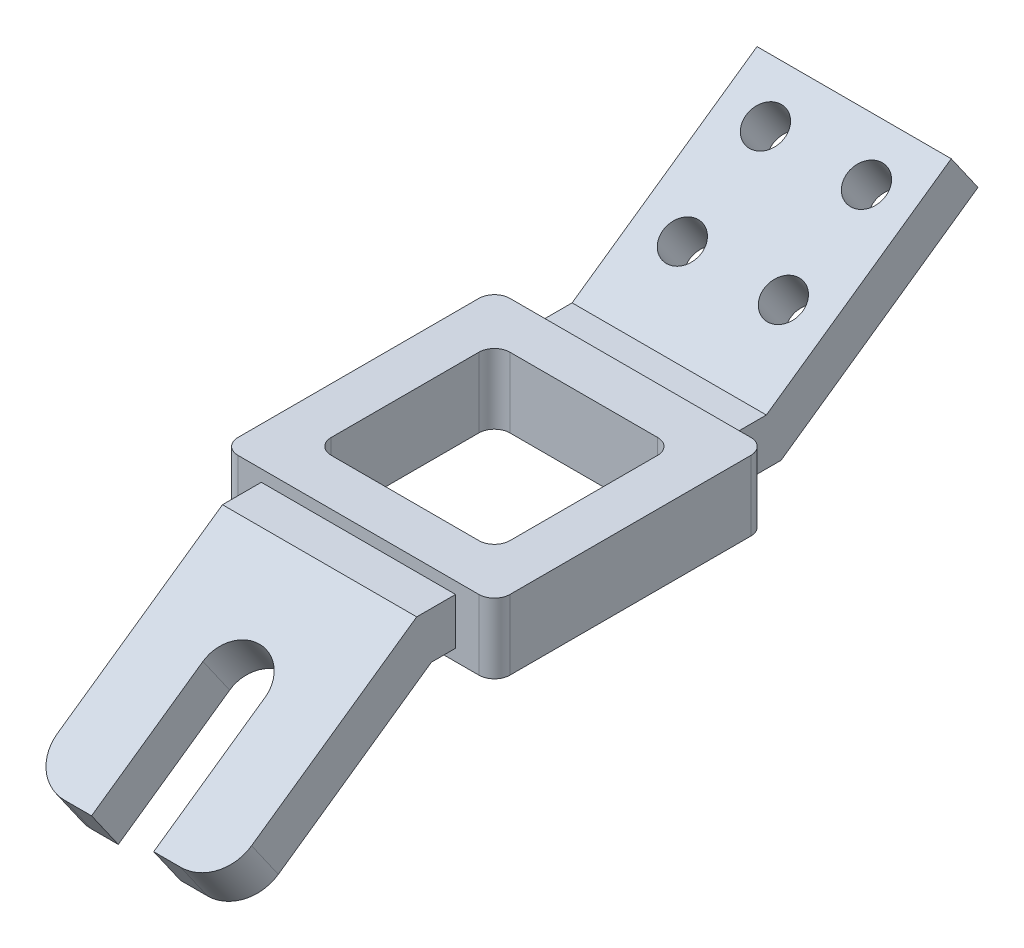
from build123d import *

# Parameters (mm, degrees)
EXTRUDE_THIN1_DEPTH = 31.75
SKETCH2_W           = 88.9
SKETCH2_H           = 88.9
EXTRUDE1_DEPTH      = 11.43
FILLET1_R           = 5.08
SKETCH3_W           = 58.42
SKETCH3_H           = 58.42
CUT_EXTRUDE1_DEPTH  = 146.273023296
FILLET2_R           = 5.08
FILLET3_R           = 12.7
CUT_EXTRUDE2_DEPTH  = 175.682206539
SKETCH5_R           = 6.35
F_4_HOLE_CUT_DEPTH  = 162.557562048


with BuildPart() as part:
    # Sketch1 → Extrude-Thin1 (new, symmetric)
    with BuildSketch(Plane(origin=(0, 0, 0), x_dir=(0, 0, -1), z_dir=(1, 0, 0))):
        Polygon((-115.19873333, -49.948463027), (-54.747423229, -7.62), (59.552576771, -7.62), (123.94003822, 37.464585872), (115.19873333, 49.948463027), (54.747423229, 7.62), (-59.552576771, 7.62), (-123.94003822, -37.464585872), align=None)
    extrude(amount=EXTRUDE_THIN1_DEPTH, both=True)

    # Sketch2 → Extrude1 (add, symmetric)
    with BuildSketch(Plane(origin=(0, 0, 0), x_dir=(1, 0, 0), z_dir=(0, 1, 0))):
        with Locations((0, -2.402576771)):
            Rectangle(SKETCH2_W, SKETCH2_H)
    extrude(amount=EXTRUDE1_DEPTH, both=True)

    # Fillet1
    fillet1_edges = [part.edges().sort_by_distance(p)[0] for p in [
        (-44.45, 0, 46.852576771),
        (44.45, 0, -42.047423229),
        (-44.45, 0, -42.047423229),
        (44.45, 0, 46.852576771),
    ]]
    fillet(fillet1_edges, radius=FILLET1_R)

    # Sketch3 → Cut-Extrude1 (cut, through all)
    with BuildSketch(Plane(origin=(0, 11.43, 0), x_dir=(-1, 0, 0), z_dir=(0, 1, 0))):
        with Locations((0, 2.402576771)):
            Rectangle(SKETCH3_W, SKETCH3_H)
    extrude(amount=-CUT_EXTRUDE1_DEPTH, mode=Mode.SUBTRACT)

    # Fillet2
    fillet2_edges = [part.edges().sort_by_distance(p)[0] for p in [
        (-29.21, 0, -26.807423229),
        (29.21, 0, -26.807423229),
        (29.21, 0, 31.612576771),
        (-29.21, 0, 31.612576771),
    ]]
    fillet(fillet2_edges, radius=FILLET2_R)

    # Fillet3
    fillet3_edges = [part.edges().sort_by_distance(p)[0] for p in [
        (31.75, -43.70652445, 119.569385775),
        (-31.75, -43.70652445, 119.569385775),
    ]]
    fillet(fillet3_edges, radius=FILLET3_R)

    # Sketch4 → Cut-Extrude2 (cut, through all)
    with BuildSketch(Plane(origin=(0, 33.093655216, 23.172426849), x_dir=(-1, 0, 0), z_dir=(0, 0.8191520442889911, 0.573576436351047))):
        with BuildLine():
            Line((10.16, 123.014539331), (10.16, 78.564539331))
            ThreePointArc((10.16, 78.564539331), (0, 68.404539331), (-10.16, 78.564539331))
            Line((-10.16, 78.564539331), (-10.16, 123.014539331))
            Line((-10.16, 123.014539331), (10.16, 123.014539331))
        make_face()
    extrude(amount=-CUT_EXTRUDE2_DEPTH, mode=Mode.SUBTRACT)

    # Sketch5 → 4 hole cut (cut, through all)
    with BuildSketch(Plane(origin=(0, -20.609778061, -14.431121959), x_dir=(-1, 0, 0), z_dir=(0, 0.819152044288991, 0.5735764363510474))):
        with Locations(Location((-16.51, -107.774539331, 0), (0, 0, 90))):
            Circle(SKETCH5_R)
        with Locations(Location((-16.51, -74.617116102, 0), (0, 0, 90))):
            Circle(SKETCH5_R)
        with Locations(Location((16.51, -107.774539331, 0), (0, 0, 90))):
            Circle(SKETCH5_R)
        with Locations(Location((16.51, -74.617116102, 0), (0, 0, 90))):
            Circle(SKETCH5_R)
    extrude(amount=-F_4_HOLE_CUT_DEPTH, mode=Mode.SUBTRACT)


solid = part.part
